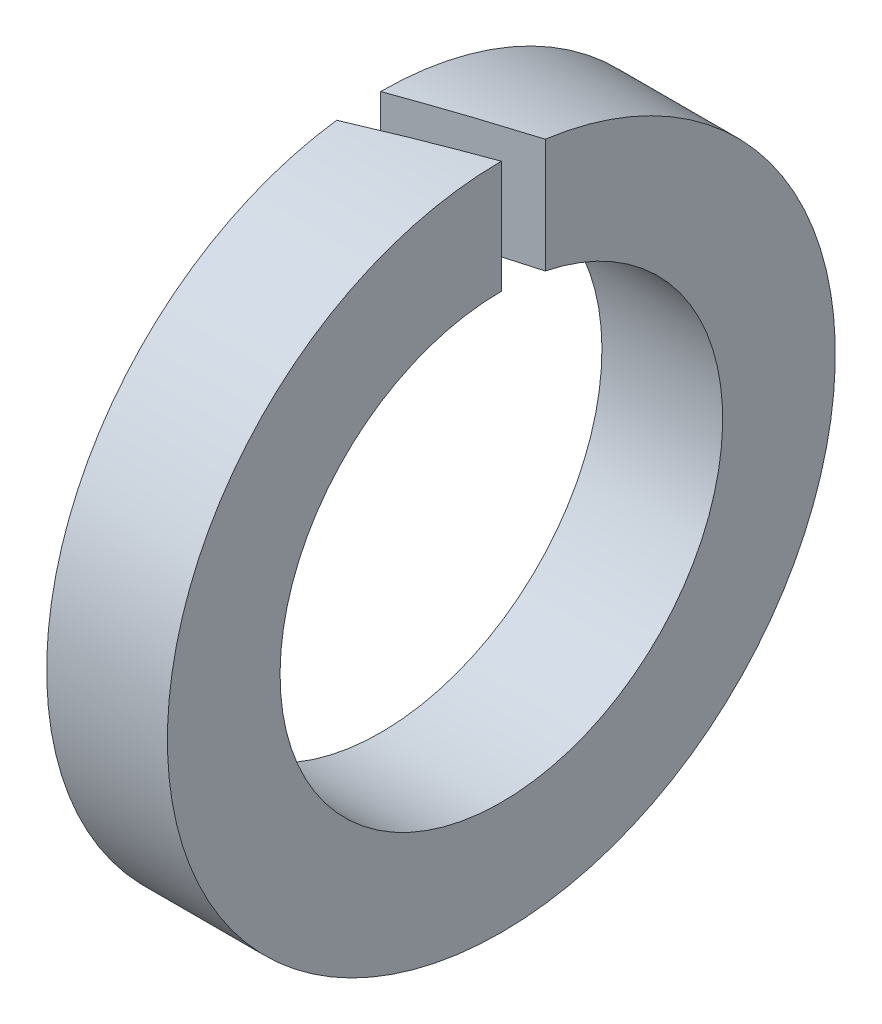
ISO-10303-21;
HEADER;
FILE_DESCRIPTION(('STEP AP214'),'2;1');
FILE_NAME('part.step','',(''),(''),'','','');
FILE_SCHEMA(('AUTOMOTIVE_DESIGN { 1 0 10303 214 1 1 1 1 }'));
ENDSEC;
DATA;
#1=APPLICATION_CONTEXT('core data for automotive mechanical design processes');
#2=APPLICATION_PROTOCOL_DEFINITION('international standard','automotive_design',2000,#1);
#3=PRODUCT_CONTEXT('',#1,'mechanical');
#4=PRODUCT('Part','Part','',(#3));
#5=PRODUCT_RELATED_PRODUCT_CATEGORY('part','',(#4));
#6=PRODUCT_DEFINITION_FORMATION('','',#4);
#7=PRODUCT_DEFINITION_CONTEXT('part definition',#1,'design');
#8=PRODUCT_DEFINITION('design','',#6,#7);
#9=PRODUCT_DEFINITION_SHAPE('','',#8);
#10=(LENGTH_UNIT() NAMED_UNIT(*) SI_UNIT(.MILLI.,.METRE.));
#11=(NAMED_UNIT(*) PLANE_ANGLE_UNIT() SI_UNIT($,.RADIAN.));
#12=(NAMED_UNIT(*) SI_UNIT($,.STERADIAN.) SOLID_ANGLE_UNIT());
#13=UNCERTAINTY_MEASURE_WITH_UNIT(LENGTH_MEASURE(1.E-05),#10,'distance_accuracy_value','');
#14=(GEOMETRIC_REPRESENTATION_CONTEXT(3) GLOBAL_UNCERTAINTY_ASSIGNED_CONTEXT((#13)) GLOBAL_UNIT_ASSIGNED_CONTEXT((#10,
#11,#12)) REPRESENTATION_CONTEXT('',''));
#15=CARTESIAN_POINT('',(0.,0.,0.));
#16=DIRECTION('',(0.,0.,1.));
#17=DIRECTION('',(1.,0.,0.));
#18=AXIS2_PLACEMENT_3D('',#15,#16,#17);
#19=CARTESIAN_POINT('',(0.,0.,-4.15));
#20=DIRECTION('',(1.,0.,0.));
#21=DIRECTION('',(0.,0.,-1.));
#22=AXIS2_PLACEMENT_3D('',#19,#20,#21);
#23=PLANE('',#22);
#24=DIRECTION('',(0.,-1.,0.));
#25=VECTOR('',#24,1.);
#26=CARTESIAN_POINT('',(0.,4.15,0.545955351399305));
#27=LINE('',#26,#25);
#28=CARTESIAN_POINT('',(0.,4.11393154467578,0.545955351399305));
#29=VERTEX_POINT('',#28);
#30=CARTESIAN_POINT('',(0.,2.69526116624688,0.545955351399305));
#31=VERTEX_POINT('',#30);
#32=EDGE_CURVE('E55',#29,#31,#27,.T.);
#33=ORIENTED_EDGE('',*,*,#32,.T.);
#34=CARTESIAN_POINT('',(0.,0.,0.));
#35=DIRECTION('',(-1.,0.,0.));
#36=DIRECTION('',(0.,0.,1.));
#37=AXIS2_PLACEMENT_3D('',#34,#35,#36);
#38=CIRCLE('',#37,2.75);
#39=CARTESIAN_POINT('',(0.,2.75,0.));
#40=VERTEX_POINT('',#39);
#41=EDGE_CURVE('E89',#40,#31,#38,.T.);
#42=ORIENTED_EDGE('',*,*,#41,.F.);
#43=DIRECTION('',(0.,-1.,0.));
#44=VECTOR('',#43,1.);
#45=CARTESIAN_POINT('',(0.,4.15,0.));
#46=LINE('',#45,#44);
#47=CARTESIAN_POINT('',(0.,4.15,0.));
#48=VERTEX_POINT('',#47);
#49=EDGE_CURVE('E98',#48,#40,#46,.T.);
#50=ORIENTED_EDGE('',*,*,#49,.F.);
#51=CARTESIAN_POINT('',(0.,0.,0.));
#52=DIRECTION('',(-1.,0.,0.));
#53=DIRECTION('',(0.,0.,1.));
#54=AXIS2_PLACEMENT_3D('',#51,#52,#53);
#55=CIRCLE('',#54,4.15);
#56=EDGE_CURVE('E87',#48,#29,#55,.T.);
#57=ORIENTED_EDGE('',*,*,#56,.T.);
#58=EDGE_LOOP('',(#33,#42,#50,#57));
#59=FACE_BOUND('',#58,.T.);
#60=ADVANCED_FACE('F34',(#59),#23,.F.);
#61=CARTESIAN_POINT('',(0.,0.,0.));
#62=DIRECTION('',(-1.,0.,0.));
#63=DIRECTION('',(0.,0.,1.));
#64=AXIS2_PLACEMENT_3D('',#61,#62,#63);
#65=CYLINDRICAL_SURFACE('',#64,2.75);
#66=CARTESIAN_POINT('',(1.5,0.,0.));
#67=DIRECTION('',(-0.342020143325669,0.,-0.939692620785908));
#68=DIRECTION('',(-0.939692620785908,0.,0.342020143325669));
#69=AXIS2_PLACEMENT_3D('',#66,#67,#68);
#70=ELLIPSE('',#69,8.04046210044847,2.75);
#71=CARTESIAN_POINT('',(1.5,2.75,0.));
#72=VERTEX_POINT('',#71);
#73=EDGE_CURVE('E91',#72,#31,#70,.F.);
#74=ORIENTED_EDGE('',*,*,#73,.F.);
#75=CARTESIAN_POINT('',(1.5,0.,0.));
#76=DIRECTION('',(-1.,0.,0.));
#77=DIRECTION('',(0.,0.,1.));
#78=AXIS2_PLACEMENT_3D('',#75,#76,#77);
#79=CIRCLE('',#78,2.75);
#80=CARTESIAN_POINT('',(1.5,2.69526116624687,-0.545955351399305));
#81=VERTEX_POINT('',#80);
#82=EDGE_CURVE('E84',#81,#72,#79,.T.);
#83=ORIENTED_EDGE('',*,*,#82,.F.);
#84=CARTESIAN_POINT('',(0.,0.,0.));
#85=DIRECTION('',(0.34202014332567,0.,0.939692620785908));
#86=DIRECTION('',(-0.939692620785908,0.,0.342020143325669));
#87=AXIS2_PLACEMENT_3D('',#84,#85,#86);
#88=ELLIPSE('',#87,8.04046210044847,2.75);
#89=EDGE_CURVE('E106',#40,#81,#88,.F.);
#90=ORIENTED_EDGE('',*,*,#89,.F.);
#91=ORIENTED_EDGE('',*,*,#41,.T.);
#92=EDGE_LOOP('',(#74,#83,#90,#91));
#93=FACE_BOUND('',#92,.T.);
#94=ADVANCED_FACE('F108',(#93),#65,.F.);
#95=CARTESIAN_POINT('',(1.5,0.,-4.15));
#96=DIRECTION('',(-1.,0.,0.));
#97=DIRECTION('',(0.,0.,1.));
#98=AXIS2_PLACEMENT_3D('',#95,#96,#97);
#99=PLANE('',#98);
#100=DIRECTION('',(0.,-1.,0.));
#101=VECTOR('',#100,1.);
#102=CARTESIAN_POINT('',(1.5,4.15,0.));
#103=LINE('',#102,#101);
#104=CARTESIAN_POINT('',(1.5,4.15,0.));
#105=VERTEX_POINT('',#104);
#106=EDGE_CURVE('E72',#105,#72,#103,.T.);
#107=ORIENTED_EDGE('',*,*,#106,.F.);
#108=CARTESIAN_POINT('',(1.5,0.,0.));
#109=DIRECTION('',(-1.,0.,0.));
#110=DIRECTION('',(0.,0.,1.));
#111=AXIS2_PLACEMENT_3D('',#108,#109,#110);
#112=CIRCLE('',#111,4.15);
#113=CARTESIAN_POINT('',(1.5,4.11393154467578,-0.545955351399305));
#114=VERTEX_POINT('',#113);
#115=EDGE_CURVE('E82',#114,#105,#112,.T.);
#116=ORIENTED_EDGE('',*,*,#115,.F.);
#117=DIRECTION('',(0.,-1.,0.));
#118=VECTOR('',#117,1.);
#119=CARTESIAN_POINT('',(1.5,4.15,-0.545955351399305));
#120=LINE('',#119,#118);
#121=EDGE_CURVE('E48',#114,#81,#120,.T.);
#122=ORIENTED_EDGE('',*,*,#121,.T.);
#123=ORIENTED_EDGE('',*,*,#82,.T.);
#124=EDGE_LOOP('',(#107,#116,#122,#123));
#125=FACE_BOUND('',#124,.T.);
#126=ADVANCED_FACE('F81',(#125),#99,.F.);
#127=CARTESIAN_POINT('',(0.,0.,0.));
#128=DIRECTION('',(-1.,0.,0.));
#129=DIRECTION('',(0.,0.,1.));
#130=AXIS2_PLACEMENT_3D('',#127,#128,#129);
#131=CYLINDRICAL_SURFACE('',#130,4.15);
#132=CARTESIAN_POINT('',(1.5,0.,0.));
#133=DIRECTION('',(-0.342020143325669,0.,-0.939692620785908));
#134=DIRECTION('',(-0.939692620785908,0.,0.342020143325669));
#135=AXIS2_PLACEMENT_3D('',#132,#133,#134);
#136=ELLIPSE('',#135,12.1337882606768,4.15);
#137=EDGE_CURVE('E11',#29,#105,#136,.T.);
#138=ORIENTED_EDGE('',*,*,#137,.F.);
#139=ORIENTED_EDGE('',*,*,#56,.F.);
#140=CARTESIAN_POINT('',(0.,0.,0.));
#141=DIRECTION('',(0.34202014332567,0.,0.939692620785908));
#142=DIRECTION('',(-0.939692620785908,0.,0.342020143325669));
#143=AXIS2_PLACEMENT_3D('',#140,#141,#142);
#144=ELLIPSE('',#143,12.1337882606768,4.15);
#145=EDGE_CURVE('E41',#114,#48,#144,.T.);
#146=ORIENTED_EDGE('',*,*,#145,.F.);
#147=ORIENTED_EDGE('',*,*,#115,.T.);
#148=EDGE_LOOP('',(#138,#139,#146,#147));
#149=FACE_BOUND('',#148,.T.);
#150=ADVANCED_FACE('F86',(#149),#131,.T.);
#151=CARTESIAN_POINT('',(0.,4.15,0.));
#152=DIRECTION('',(0.34202014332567,0.,0.939692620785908));
#153=DIRECTION('',(0.939692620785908,0.,-0.34202014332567));
#154=AXIS2_PLACEMENT_3D('',#151,#152,#153);
#155=PLANE('',#154);
#156=ORIENTED_EDGE('',*,*,#89,.T.);
#157=ORIENTED_EDGE('',*,*,#121,.F.);
#158=ORIENTED_EDGE('',*,*,#145,.T.);
#159=ORIENTED_EDGE('',*,*,#49,.T.);
#160=EDGE_LOOP('',(#156,#157,#158,#159));
#161=FACE_BOUND('',#160,.T.);
#162=ADVANCED_FACE('F97',(#161),#155,.T.);
#163=CARTESIAN_POINT('',(1.5,4.15,0.));
#164=DIRECTION('',(-0.342020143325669,0.,-0.939692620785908));
#165=DIRECTION('',(-0.939692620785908,0.,0.342020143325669));
#166=AXIS2_PLACEMENT_3D('',#163,#164,#165);
#167=PLANE('',#166);
#168=ORIENTED_EDGE('',*,*,#73,.T.);
#169=ORIENTED_EDGE('',*,*,#32,.F.);
#170=ORIENTED_EDGE('',*,*,#137,.T.);
#171=ORIENTED_EDGE('',*,*,#106,.T.);
#172=EDGE_LOOP('',(#168,#169,#170,#171));
#173=FACE_BOUND('',#172,.T.);
#174=ADVANCED_FACE('F71',(#173),#167,.T.);
#175=CLOSED_SHELL('',(#60,#94,#126,#150,#162,#174));
#176=MANIFOLD_SOLID_BREP('B2',#175);
#177=ADVANCED_BREP_SHAPE_REPRESENTATION('',(#18,#176),#14);
#178=SHAPE_DEFINITION_REPRESENTATION(#9,#177);
ENDSEC;
END-ISO-10303-21;
